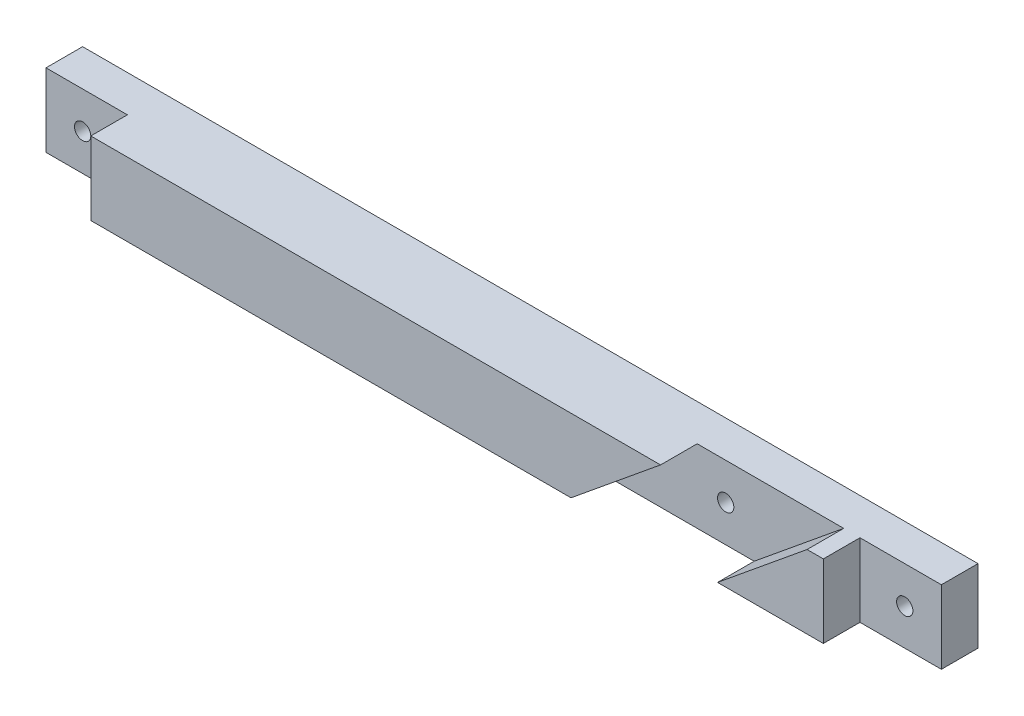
from build123d import *

# Parameters (mm, degrees)
ESQUISSE1_W             = 110
ESQUISSE1_H             = 9
EXTRUSION1_DEPTH        = 9
ESQUISSE2_W             = 10
ESQUISSE2_H             = 9
ENL_V_MAT_EXTRU_1_DEPTH = 4.5
ESQUISSE4_R             = 1
ENL_V_MAT_EXTRU_2_DEPTH = 4.5
ESQUISSE5_R             = 1
ENL_V_MAT_EXTRU_3_DEPTH = 4.5
ENL_V_MAT_EXTRU_4_DEPTH = 4.5
ESQUISSE7_R             = 1
ENL_V_MAT_EXTRU_5_DEPTH = 4.5


with BuildPart() as part:
    # Esquisse1 → Extrusion1 (new body)
    with BuildSketch(Plane.XY):
        with Locations((-12.271684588, -105.117562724)):
            Rectangle(ESQUISSE1_W, ESQUISSE1_H)
    extrude(amount=EXTRUSION1_DEPTH)

    # Esquisse2 → Enl_v. mat.-Extru.1 (cut)
    with BuildSketch(Plane.XY.offset(9)):
        with Locations((-62.271684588, -105.117562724)):
            Rectangle(ESQUISSE2_W, ESQUISSE2_H)
        with Locations((37.728315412, -105.117562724)):
            Rectangle(ESQUISSE2_W, ESQUISSE2_H)
    extrude(amount=-ENL_V_MAT_EXTRU_1_DEPTH, mode=Mode.SUBTRACT)

    # Esquisse4 → Enl_v. mat.-Extru.2 (cut)
    with BuildSketch(Plane.XY.offset(4.5)):
        with Locations((38.22840174, -105.145436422)):
            Circle(ESQUISSE4_R)
    extrude(amount=-ENL_V_MAT_EXTRU_2_DEPTH, mode=Mode.SUBTRACT)

    # Esquisse5 → Enl_v. mat.-Extru.3 (cut)
    with BuildSketch(Plane.XY.offset(4.5)):
        with Locations((-62.771684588, -105.117562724)):
            Circle(ESQUISSE5_R)
    extrude(amount=-ENL_V_MAT_EXTRU_3_DEPTH, mode=Mode.SUBTRACT)

    # Esquisse6 → Enl_v. mat.-Extru.4 (cut)
    with BuildSketch(Plane.XY.offset(9)):
        Polygon((12.728315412, -100.617562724), (30.728315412, -100.617562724), (19.728315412, -109.617562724), (1.728315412, -109.617562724), align=None)
    extrude(amount=-ENL_V_MAT_EXTRU_4_DEPTH, mode=Mode.SUBTRACT)

    # Esquisse7 → Enl_v. mat.-Extru.5 (cut)
    with BuildSketch(Plane.XY.offset(4.5)):
        with Locations((16.228315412, -105.117562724)):
            Circle(ESQUISSE7_R)
    extrude(amount=-ENL_V_MAT_EXTRU_5_DEPTH, mode=Mode.SUBTRACT)


solid = part.part
